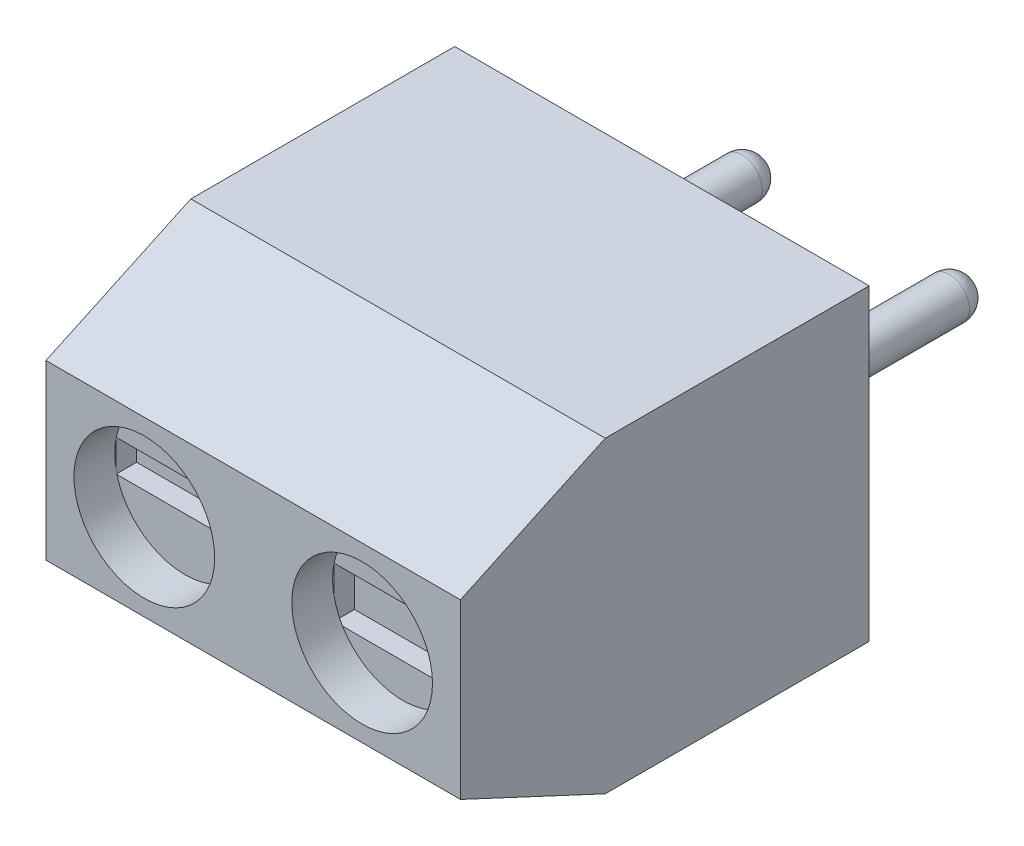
from build123d import *
from OCP.BRepFilletAPI import BRepFilletAPI_MakeChamfer

# Parameters (mm, degrees)
ESQUISSE1_W             = 10.16
ESQUISSE1_H             = 7.55
EXTRUSION1_DEPTH        = 10.02
CHANFREIN1_SIZE         = 3.55
CHANFREIN1_SIZE2        = 1.655392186
ESQUISSE2_R             = 1.725
ENL_V_MAT_EXTRU_1_DEPTH = 1
ESQUISSE3_W             = 4
ESQUISSE3_H             = 5
ENL_V_MAT_EXTRU_2_DEPTH = 1.6
ESQUISSE4_R             = 1.675
ENL_V_MAT_EXTRU_3_DEPTH = 1.6
ESQUISSE5_R             = 0.5
EXTRUSION2_DEPTH        = 5
CONG_1_R                = 0.5
ESQUISSE7_W             = 3.359641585
ESQUISSE7_H             = 0.780050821
ESQUISSE7_W_2           = 3.169641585
ESQUISSE7_H_2           = 1.23511091
ENL_V_MAT_EXTRU_4_DEPTH = 0.5
ESQUISSE8_W             = 3.1960084
ESQUISSE8_H             = 1.003036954
ESQUISSE8_W_2           = 3.1010084
ESQUISSE8_H_2           = 1.248310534
ENL_V_MAT_EXTRU_5_DEPTH = 0.5


with BuildPart() as part:
    # Esquisse1 → Extrusion1 (new body)
    with BuildSketch(Plane.XY):
        with Locations((5.08, 3.775)):
            Rectangle(ESQUISSE1_W, ESQUISSE1_H)
    extrude(amount=EXTRUSION1_DEPTH)

    # Chanfrein1: one chamfer whose edges measure the first distance from different faces: ONE call of the kernel's chamfer builder (chamfer() names one face for all edges)
    chanfrein1_edges_1 = [part.edges().sort_by_distance(p)[0] for p in [
        (5.08, 7.55, 10.02),
    ]]
    chanfrein1_side_1 = [part.faces().sort_by_distance(p)[0] for p in [
        (5.08, 7.55, 5.01),
    ]]
    chanfrein1_edges_2 = [part.edges().sort_by_distance(p)[0] for p in [
        (5.08, 0, 10.02),
    ]]
    chanfrein1_side_2 = [part.faces().sort_by_distance(p)[0] for p in [
        (5.08, 0, 5.01),
    ]]
    chanfrein1 = BRepFilletAPI_MakeChamfer(part.part.solid().wrapped)
    for e in chanfrein1_edges_1:
        chanfrein1.Add(CHANFREIN1_SIZE, CHANFREIN1_SIZE2, e.wrapped, chanfrein1_side_1[0].wrapped)  # the first distance lies on this face
    for e in chanfrein1_edges_2:
        chanfrein1.Add(CHANFREIN1_SIZE, CHANFREIN1_SIZE2, e.wrapped, chanfrein1_side_2[0].wrapped)  # the first distance lies on this face
    add(Compound.cast(chanfrein1.Shape()), mode=Mode.REPLACE)

    # Esquisse2 → Enl_v. mat.-Extru.1 (cut)
    with BuildSketch(Plane.XY.offset(10.02)):
        with Locations((2.410120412, 3.775)):
            Circle(ESQUISSE2_R)
        with Locations((7.749879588, 3.775)):
            Circle(ESQUISSE2_R)
    extrude(amount=-ENL_V_MAT_EXTRU_1_DEPTH, mode=Mode.SUBTRACT)

    # Esquisse3 → Enl_v. mat.-Extru.2 (cut)
    with BuildSketch(Plane.XZ):
        with Locations((7.53, 3.3)):
            Rectangle(ESQUISSE3_W, ESQUISSE3_H)
        with Locations((2.63, 3.3)):
            Rectangle(ESQUISSE3_W, ESQUISSE3_H)
    extrude(amount=-ENL_V_MAT_EXTRU_2_DEPTH, mode=Mode.SUBTRACT)

    # Esquisse4 → Enl_v. mat.-Extru.3 (cut)
    with BuildSketch(Plane.XZ.offset(-1.6)):
        with Locations(Location((7.53, 3.235, 0), (0, 0, 270))):
            Circle(ESQUISSE4_R)
        with Locations(Location((2.535, 3.235, 0), (0, 0, 270))):
            Circle(ESQUISSE4_R)
    extrude(amount=-ENL_V_MAT_EXTRU_3_DEPTH, mode=Mode.SUBTRACT)

    # Esquisse5 → Extrusion2 (add)
    with BuildSketch(Plane(origin=(0, 0, 0), x_dir=(-1, 0, 0), z_dir=(0, 0, -1))):
        with Locations((-7.62, 3.775)):
            Circle(ESQUISSE5_R)
        with Locations((-2.54, 3.775)):
            Circle(ESQUISSE5_R)
    extrude(amount=EXTRUSION2_DEPTH)

    # Cong_1
    cong_1_edges = [part.edges().sort_by_distance(p)[0] for p in [
        (8.12, 3.775, -5),
        (3.04, 3.775, -5),
    ]]
    fillet(cong_1_edges, radius=CONG_1_R)

    # Esquisse7 → Enl_v. mat.-Extru.4 (cut)
    with BuildSketch(Plane.XY.offset(9.02)):
        with Locations((2.40077537, 3.734751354)):
            Rectangle(ESQUISSE7_W, ESQUISSE7_H)
        with Locations((7.645534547, 3.507221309)):
            Rectangle(ESQUISSE7_W_2, ESQUISSE7_H_2)
    extrude(amount=-ENL_V_MAT_EXTRU_4_DEPTH, mode=Mode.SUBTRACT)

    # Esquisse8 → Enl_v. mat.-Extru.5 (cut)
    with BuildSketch(Plane.XZ.offset(-3.2)):
        with Locations((2.54160667, 3.256051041)):
            Rectangle(ESQUISSE8_W, ESQUISSE8_H)
        with Locations((7.48910667, 3.133414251)):
            Rectangle(ESQUISSE8_W_2, ESQUISSE8_H_2)
    extrude(amount=-ENL_V_MAT_EXTRU_5_DEPTH, mode=Mode.SUBTRACT)


solid = part.part
